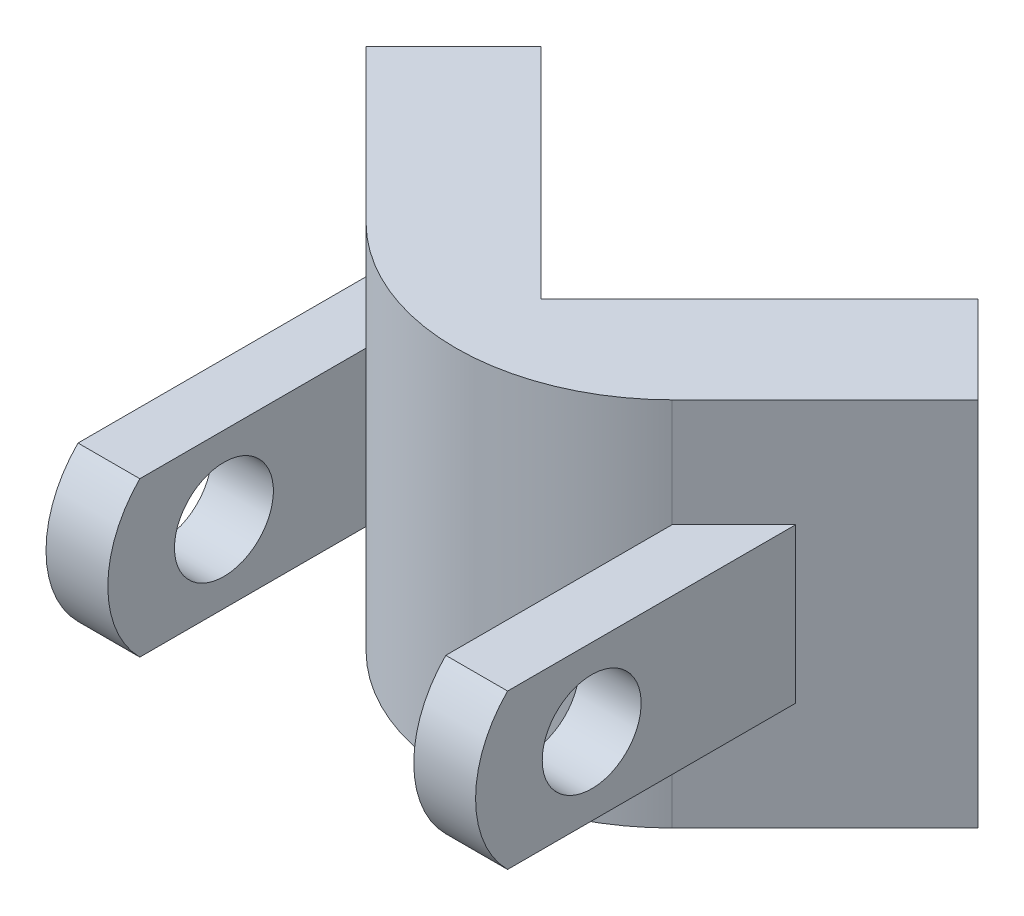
from build123d import *

# Parameters (mm, degrees)
BOSS_EXTRUDE2_DEPTH = 15.24
BOSS_EXTRUDE3_DEPTH = 6.35
BOSS_EXTRUDE5_DEPTH = 6.35
SKETCH9_R           = 4.064
CUT_EXTRUDE1_DEPTH  = 52.689149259
CUT_EXTRUDE4_DEPTH  = 47.574757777
CUT_EXTRUDE7_DEPTH  = 52.689149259


with BuildPart() as part:
    # Sketch3 → Boss-Extrude2 (new, symmetric)
    with BuildSketch(Plane(origin=(0, 0, 0), x_dir=(1, 0, 0), z_dir=(0, 1, 0))):
        Polygon((0, 0), (17.960512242, 17.960512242), (25.144717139, 10.776307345), (0, -14.368409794), (-25.144717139, 10.776307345), (-17.960512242, 17.960512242), align=None)
    extrude(amount=BOSS_EXTRUDE2_DEPTH, both=True)

    # Sketch5 → Boss-Extrude3 (add, symmetric)
    with BuildSketch(Plane(origin=(0, 0, 0), x_dir=(1, 0, 0), z_dir=(0, 1, 0))):
        Polygon((-12.572358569, -1.796051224), (-12.572358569, -24.656051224), (-17.652358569, -24.656051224), (-17.652358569, 3.283948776), align=None)
    extrude(amount=BOSS_EXTRUDE3_DEPTH, both=True)

    # Sketch7 → Boss-Extrude5 (add, symmetric)
    with BuildSketch(Plane(origin=(0, 0, 0), x_dir=(1, 0, 0), z_dir=(0, 1, 0))):
        Polygon((12.572358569, -1.796051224), (12.572358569, -24.656051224), (17.652358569, -24.656051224), (17.652358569, 4.918458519), align=None)
    extrude(amount=BOSS_EXTRUDE5_DEPTH, both=True)

    # Sketch9 → Cut-Extrude1 (cut, through all)
    with BuildSketch(Plane.ZY.offset(17.652358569)):
        with Locations((13.480051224, 0)):
            Circle(SKETCH9_R)
    extrude(amount=-CUT_EXTRUDE1_DEPTH, mode=Mode.SUBTRACT)

    # Sketch11 → Cut-Extrude4 (cut, through all)
    with BuildSketch(Plane(origin=(0, 15.24, 0), x_dir=(1, 0, 0), z_dir=(0, 1, 0))):
        with BuildLine():
            Line((12.572358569, -1.796051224), (12.572358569, -14.489681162))
            Line((12.572358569, -14.489681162), (-12.572358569, -14.489681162))
            Line((-12.572358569, -14.489681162), (-12.572358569, -1.796051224))
            ThreePointArc((-12.572358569, -1.796051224), (0, -6.999073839), (12.572358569, -1.796051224))
        make_face()
    extrude(amount=-CUT_EXTRUDE4_DEPTH, mode=Mode.SUBTRACT)

    # Sketch14 → Cut-Extrude7 (cut, through all)
    with BuildSketch(Plane.ZY.offset(17.652358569)):
        with BuildLine():
            Line((20.391777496, 6.35), (24.656051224, 6.35))
            Line((24.656051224, 6.35), (24.656051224, -6.35))
            Line((24.656051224, -6.35), (20.391777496, -6.35))
            ThreePointArc((20.391777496, -6.35), (23.022033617, 0), (20.391777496, 6.35))
        make_face()
    extrude(amount=-CUT_EXTRUDE7_DEPTH, mode=Mode.SUBTRACT)


solid = part.part
